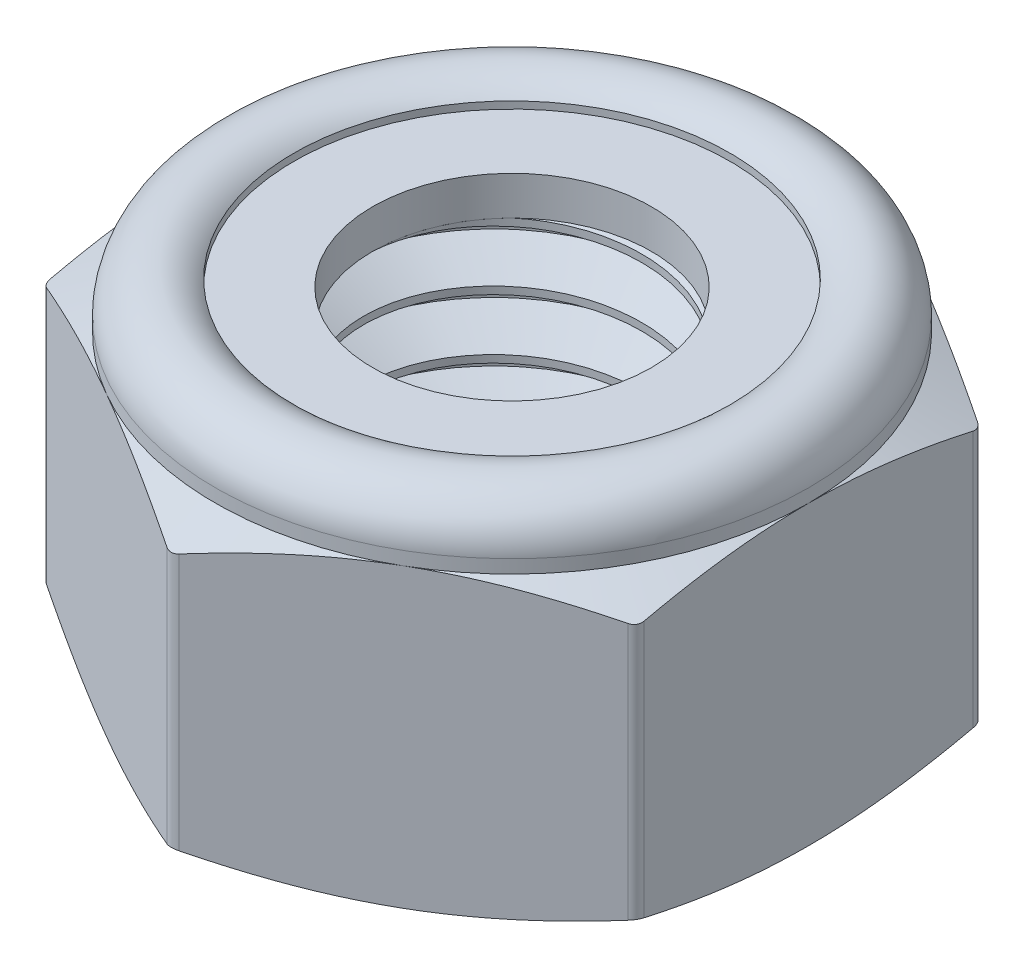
from build123d import *

# Parameters (mm, degrees)
BOSS_EXTRUDE1_DEPTH      = 3
BOSS_EXTRUDE1_DEPTH_BACK = 3
SKETCH2_R                = 2.350480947
FILLET1_R                = 0.2
SKETCH4_W                = 1.324759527
SKETCH4_H                = 0.652707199
SKETCH6_W                = 3
SKETCH6_H                = 5
CUT_SWEEP1_PITCH         = 1
CUT_SWEEP1_HEIGHT        = 6
CUT_SWEEP1_RADIUS        = 3
CUT_SWEEP1_START_ANGLE   = 90
SKETCH10_R               = 2.950480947
BOSS_EXTRUDE2_DEPTH      = 5


with BuildPart() as part:
    # Sketch2 → Boss-Extrude1 (new, two sides: drawn at the far end of the back side and taken through both)
    with BuildSketch(Plane(origin=(0, 0, 0), x_dir=(1, 0, 0), z_dir=(0, 1, 0)).offset(-BOSS_EXTRUDE1_DEPTH_BACK)):
        Polygon((0, 5.773502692), (-5, 2.886751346), (-5, -2.886751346), (0, -5.773502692), (5, -2.886751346), (5, 2.886751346), align=None)
        with Locations(Location((0, 0, 0), (0, 0, 270))):
            Circle(SKETCH2_R, mode=Mode.SUBTRACT)
    extrude(amount=BOSS_EXTRUDE1_DEPTH + BOSS_EXTRUDE1_DEPTH_BACK)

    # Fillet1
    fillet1_edges = [part.edges().sort_by_distance(p)[0] for p in [
        (5, 0, -2.886751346),
        (5, 0, 2.886751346),
        (0, 0, 5.773502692),
        (-5, 0, 2.886751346),
        (-5, 0, -2.886751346),
        (0, 0, -5.773502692),
    ]]
    fillet(fillet1_edges, radius=FILLET1_R)

    # Sketch3 → Cut-Revolve2 (revolve, cut)
    with BuildSketch(Plane(origin=(0, 0, 0), x_dir=(0, 0, -1), z_dir=(1, 0, 0)), mode=Mode.PRIVATE) as cut_revolve2_sk:
        with BuildLine():
            Line((5.773502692, 2), (5.773502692, 4))
            Line((5.773502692, 4), (2.350480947, 4))
            Line((2.350480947, 4), (2.350480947, 2))
            Line((2.350480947, 2), (3.675240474, 2))
            Line((3.675240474, 2), (3.675240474, 2.772707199))
            ThreePointArc((3.675240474, 2.772707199), (4.520946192, 2.940928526), (5, 2.223973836))
            Line((5, 2.223973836), (5, 2))
            Line((5, 2), (5.773502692, 1.639309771))
            Line((5.773502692, 1.639309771), (5.773502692, 2))
        make_face()
        Polygon((5, -3), (5.773502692, -2.639309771), (5.773502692, -3), align=None)
        Polygon((2.350480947, -3), (2.350480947, -2.4), (2.950480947, -3), align=None)
    revolve(cut_revolve2_sk.sketch.rotate(Axis((0, -3, 0), (0, 1, 0)), 270), axis=Axis((0, -3, 0), (0, 1, 0)), mode=Mode.SUBTRACT)

    # Sketch10 → Boss-Extrude2 (add)
    with BuildSketch(Plane.XZ.offset(3)):
        Circle(SKETCH10_R)
    extrude(amount=-BOSS_EXTRUDE2_DEPTH)


with BuildPart() as body_2:
    # Sketch4 → Revolve1 (revolve)
    with BuildSketch(Plane(origin=(0, 0, 0), x_dir=(0, 0, -1), z_dir=(1, 0, 0)), mode=Mode.PRIVATE) as revolve1_sk:
        with Locations((-3.012860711, 2.326353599)):
            Rectangle(SKETCH4_W, SKETCH4_H)
    revolve(revolve1_sk.sketch.rotate(Axis((0, -3, 0), (0, 1, 0)), 90), axis=Axis((0, -3, 0), (0, 1, 0)))


with BuildPart() as body_3:
    # Sketch6 → Revolve2 (revolve)
    with BuildSketch(Plane.XY, mode=Mode.PRIVATE) as revolve2_sk:
        with Locations((1.5, -0.5)):
            Rectangle(SKETCH6_W, SKETCH6_H)
    revolve(revolve2_sk.sketch.rotate(Axis((0, -3, 0), (0, 1, 0)), 90), axis=Axis((0, -3, 0), (0, 1, 0)))

    # Cut-Sweep1: sweep along a helix
    with BuildLine() as cut_sweep1_path:
        add(Helix(CUT_SWEEP1_PITCH, CUT_SWEEP1_HEIGHT, CUT_SWEEP1_RADIUS, center=(0, -3, 0), direction=(0, 1, 0), mode=Mode.PRIVATE).rotate(Axis((0, -3, 0), (0, 1, 0)), CUT_SWEEP1_START_ANGLE))
    # Sketch8 → Cut-Sweep1 (sweep, cut)
    with BuildSketch(Plane.XY):
        Polygon((2.350480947, -3.375), (2.350480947, -3.5), (3.054126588, -3.90625), (3.108253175, -2.9375), align=None)
    sweep(path=cut_sweep1_path.line, is_frenet=True, mode=Mode.SUBTRACT)

    # Sketch9 → Revolve3 (revolve)
    with BuildSketch(Plane.XY, mode=Mode.PRIVATE) as revolve3_sk:
        Polygon((0, 0), (0, -3), (3, -3), (3.6, -3), (0, 0.6), align=None)
    revolve(revolve3_sk.sketch.rotate(Axis((0, 0, 0), (0, -1, 0)), 90.182506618), axis=Axis((0, 0, 0), (0, -1, 0)))


with BuildPart() as part_1:
    add(part.part)

    # Combine1: cut body 3
    add(body_3.part, mode=Mode.SUBTRACT)


solid = Compound([body_2.part, part_1.part])
